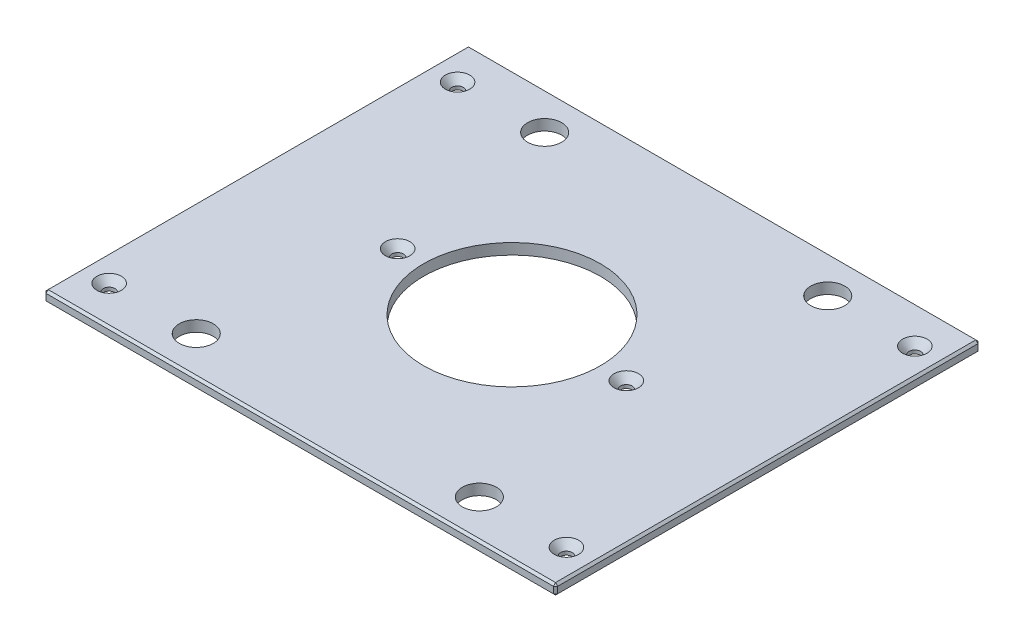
from build123d import *

# Parameters (mm, degrees)
SKETCH1_W                                     = 298.45
SKETCH1_H                                     = 247.65
BOSS_EXTRUDE1_DEPTH                           = 6.35
SKETCH13_R                                    = 51.562
CUT_EXTRUDE6_DEPTH                            = 195.013024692
F_25_32_0_78125_DIAMETER_HOLE1_D              = 19.84375
CHAMFER2_SIZE                                 = 1.27
CSK_FOR_1_4_FLAT_HEAD_MACHINE_SCREW1_AT_COUNT = 2
CSK_FOR_1_4_FLAT_HEAD_MACHINE_SCREW1_AT_PITCH = 203.2
CSK_FOR_1_4_FLAT_HEAD_MACHINE_SCREW1_2_COUNT  = 2
CSK_FOR_1_4_FLAT_HEAD_MACHINE_SCREW1_2_PITCH  = 335.289621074
CSK_FOR_1_4_FLAT_HEAD_MACHINE_SCREW1_3_COUNT  = 2
CSK_FOR_1_4_FLAT_HEAD_MACHINE_SCREW1_3_PITCH  = 224.349193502
CSK_FOR_1_4_FLAT_HEAD_MACHINE_SCREW1_4_COUNT  = 2
CSK_FOR_1_4_FLAT_HEAD_MACHINE_SCREW1_4_PITCH  = 121.524135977
CSK_FOR_1_4_FLAT_HEAD_MACHINE_SCREW1_5_COUNT  = 2
CSK_FOR_1_4_FLAT_HEAD_MACHINE_SCREW1_5_PITCH  = 266.7
CSK_FOR_1_4_FLAT_HEAD_MACHINE_SCREW1_6_COUNT  = 2
CSK_FOR_1_4_FLAT_HEAD_MACHINE_SCREW1_6_PITCH  = 215.9
CSK_FOR_1_4_FLAT_HEAD_MACHINE_SCREW1_7_COUNT  = 2
CSK_FOR_1_4_FLAT_HEAD_MACHINE_SCREW1_7_PITCH  = 296.48448526


with BuildPart() as part:
    # Sketch1 → Boss-Extrude1 (new body)
    with BuildSketch(Plane(origin=(0, 0, 0), x_dir=(1, 0, 0), z_dir=(0, 1, 0))):
        Rectangle(SKETCH1_W, SKETCH1_H)
    extrude(amount=BOSS_EXTRUDE1_DEPTH)

    # Sketch13 → Cut-Extrude6 (cut, through all)
    with BuildSketch(Plane(origin=(0, 6.35, 0), x_dir=(1, 0, 0), z_dir=(0, 1, 0))):
        with Locations(Location((0, 0, 0), (0, 0, 270))):
            Circle(SKETCH13_R)
    extrude(amount=-CUT_EXTRUDE6_DEPTH, mode=Mode.SUBTRACT)

    # 25_32 _0.78125_ Diameter Hole1 (through all)
    with Locations(Plane(origin=(0, 6.35, 0), x_dir=(1, 0, 0), z_dir=(0, 1, 0))):
        with Locations((82.55, 101.6), (-82.55, 101.6), (82.55, -101.6), (-82.55, -101.6)):
            Hole(F_25_32_0_78125_DIAMETER_HOLE1_D / 2)

    # Chamfer2
    chamfer2_edges = [part.edges().sort_by_distance(p)[0] for p in [
        (149.225, 6.35, 0),
        (0, 6.35, -123.825),
        (-149.225, 6.35, 0),
        (0, 0, -123.825),
        (149.225, 0, 0),
        (0, 0, 123.825),
        (-149.225, 0, 0),
        (0, 6.35, 123.825),
        (-149.225, 3.175, -123.825),
        (149.225, 3.175, -123.825),
        (149.225, 3.175, 123.825),
        (-149.225, 3.175, 123.825),
    ]]
    chamfer(chamfer2_edges, length=CHAMFER2_SIZE)

    # Sketch24 → CSK for 1_4 Flat Head Machine Screw1 (revolve, cut)
    with BuildSketch(Plane(origin=(133.35, 6.35, -101.6), x_dir=(0, 0, 1), z_dir=(1, 0, 0))):
        Polygon((0, 0), (0, 6.35), (3.3782, 6.35), (3.3782, 4.324464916), (7.1374, 0), align=None)
    csk_for_1_4_flat_head_machine_screw1 = revolve(axis=Axis((133.35, 12.7, -101.6), (0, -1, 0)), mode=Mode.SUBTRACT)

    # CSK for 1_4 Flat Head Machine Screw1 at: CSK for 1_4 Flat Head Machine Screw1 ×2
    with Locations(*[(0, 0, i * CSK_FOR_1_4_FLAT_HEAD_MACHINE_SCREW1_AT_PITCH) for i in range(1, CSK_FOR_1_4_FLAT_HEAD_MACHINE_SCREW1_AT_COUNT)]):
        add(csk_for_1_4_flat_head_machine_screw1, mode=Mode.SUBTRACT)

    # CSK for 1_4 Flat Head Machine Screw1 2: CSK for 1_4 Flat Head Machine Screw1 ×2
    with Locations(*[Vector(-0.7954317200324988, 0, 0.6060432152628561) * (i * CSK_FOR_1_4_FLAT_HEAD_MACHINE_SCREW1_2_PITCH) for i in range(1, CSK_FOR_1_4_FLAT_HEAD_MACHINE_SCREW1_2_COUNT)]):
        add(csk_for_1_4_flat_head_machine_screw1, mode=Mode.SUBTRACT)

    # CSK for 1_4 Flat Head Machine Screw1 3: CSK for 1_4 Flat Head Machine Screw1 ×2
    with Locations(*[Vector(-0.8915788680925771, 0, 0.452865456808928) * (i * CSK_FOR_1_4_FLAT_HEAD_MACHINE_SCREW1_3_PITCH) for i in range(1, CSK_FOR_1_4_FLAT_HEAD_MACHINE_SCREW1_3_COUNT)]):
        add(csk_for_1_4_flat_head_machine_screw1, mode=Mode.SUBTRACT)

    # CSK for 1_4 Flat Head Machine Screw1 4: CSK for 1_4 Flat Head Machine Screw1 ×2
    with Locations(*[Vector(-0.5486564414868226, 0, 0.8360479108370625) * (i * CSK_FOR_1_4_FLAT_HEAD_MACHINE_SCREW1_4_PITCH) for i in range(1, CSK_FOR_1_4_FLAT_HEAD_MACHINE_SCREW1_4_COUNT)]):
        add(csk_for_1_4_flat_head_machine_screw1, mode=Mode.SUBTRACT)

    # CSK for 1_4 Flat Head Machine Screw1 5: CSK for 1_4 Flat Head Machine Screw1 ×2
    with Locations(*[(-i * CSK_FOR_1_4_FLAT_HEAD_MACHINE_SCREW1_5_PITCH, 0, 0) for i in range(1, CSK_FOR_1_4_FLAT_HEAD_MACHINE_SCREW1_5_COUNT)]):
        add(csk_for_1_4_flat_head_machine_screw1, mode=Mode.SUBTRACT)

    # CSK for 1_4 Flat Head Machine Screw1 6: CSK for 1_4 Flat Head Machine Screw1 ×2
    with Locations(*[(-i * CSK_FOR_1_4_FLAT_HEAD_MACHINE_SCREW1_6_PITCH, 0, 0) for i in range(1, CSK_FOR_1_4_FLAT_HEAD_MACHINE_SCREW1_6_COUNT)]):
        add(csk_for_1_4_flat_head_machine_screw1, mode=Mode.SUBTRACT)

    # CSK for 1_4 Flat Head Machine Screw1 7: CSK for 1_4 Flat Head Machine Screw1 ×2
    with Locations(*[Vector(-0.728199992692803, 0, 0.685364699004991) * (i * CSK_FOR_1_4_FLAT_HEAD_MACHINE_SCREW1_7_PITCH) for i in range(1, CSK_FOR_1_4_FLAT_HEAD_MACHINE_SCREW1_7_COUNT)]):
        add(csk_for_1_4_flat_head_machine_screw1, mode=Mode.SUBTRACT)


solid = part.part
